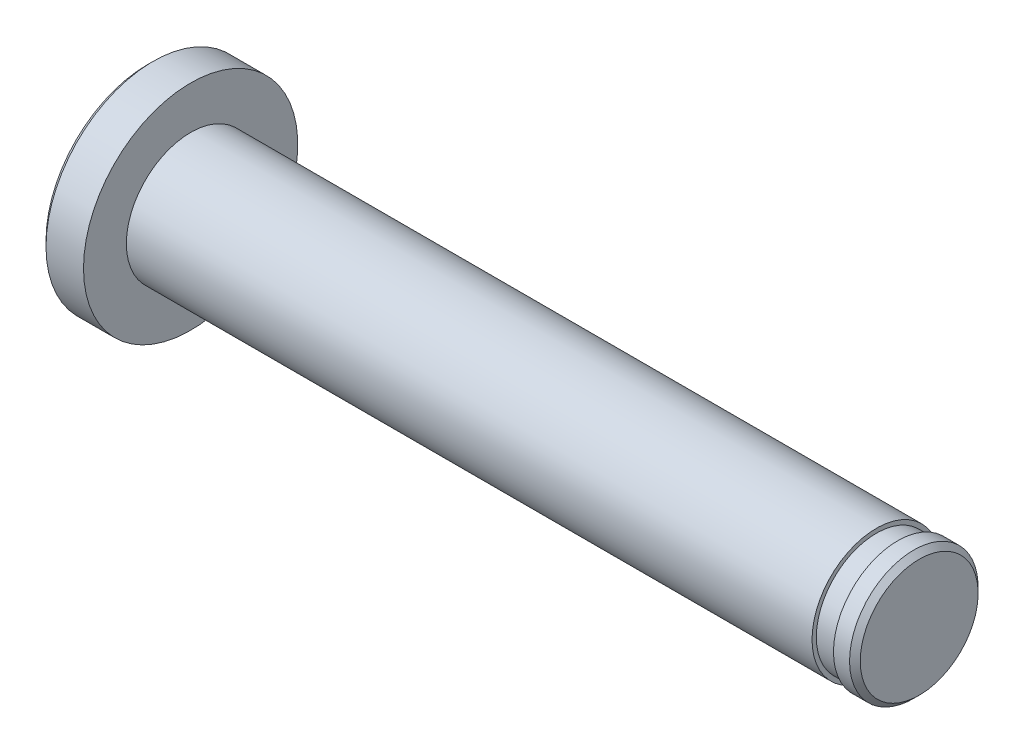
from build123d import *


with BuildPart() as part:
    # Esquisse1 → Base-R_volution (revolve)
    with BuildSketch(Plane.XY, mode=Mode.PRIVATE) as base_r_volution_sk:
        Polygon((-2, 0), (-2, 4.75), (-1.75, 5), (0, 5), (0, 3), (32, 3), (32, 2.8), (33, 2.8), (33, 3), (33.75, 3), (34, 2.75), (34, 0), align=None)
    revolve(base_r_volution_sk.sketch.rotate(Axis((0, 0, 0), (1, 0, 0)), 90), axis=Axis((0, 0, 0), (1, 0, 0)))


solid = part.part
